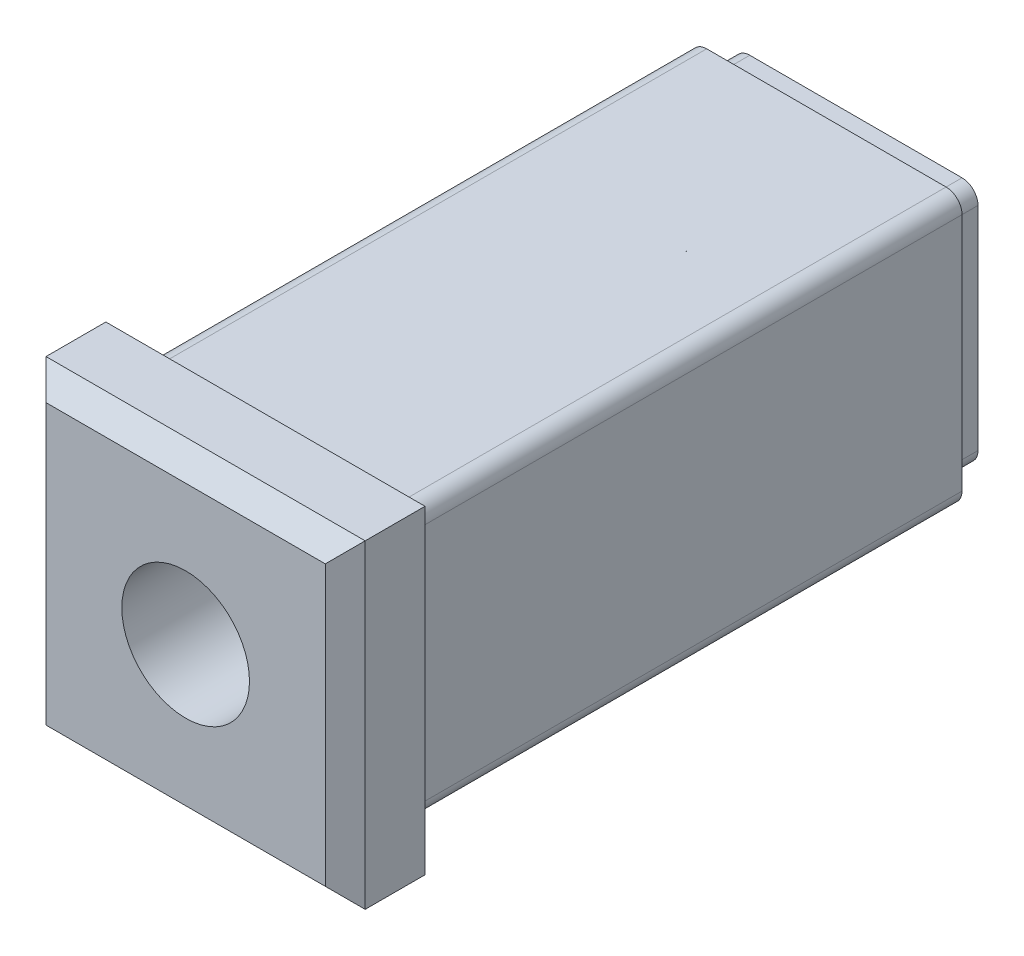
ISO-10303-21;
HEADER;
FILE_DESCRIPTION(('STEP AP214'),'2;1');
FILE_NAME('part.step','',(''),(''),'','','');
FILE_SCHEMA(('AUTOMOTIVE_DESIGN { 1 0 10303 214 1 1 1 1 }'));
ENDSEC;
DATA;
#1=APPLICATION_CONTEXT('core data for automotive mechanical design processes');
#2=APPLICATION_PROTOCOL_DEFINITION('international standard','automotive_design',2000,#1);
#3=PRODUCT_CONTEXT('',#1,'mechanical');
#4=PRODUCT('Part','Part','',(#3));
#5=PRODUCT_RELATED_PRODUCT_CATEGORY('part','',(#4));
#6=PRODUCT_DEFINITION_FORMATION('','',#4);
#7=PRODUCT_DEFINITION_CONTEXT('part definition',#1,'design');
#8=PRODUCT_DEFINITION('design','',#6,#7);
#9=PRODUCT_DEFINITION_SHAPE('','',#8);
#10=(LENGTH_UNIT() NAMED_UNIT(*) SI_UNIT(.MILLI.,.METRE.));
#11=(NAMED_UNIT(*) PLANE_ANGLE_UNIT() SI_UNIT($,.RADIAN.));
#12=(NAMED_UNIT(*) SI_UNIT($,.STERADIAN.) SOLID_ANGLE_UNIT());
#13=UNCERTAINTY_MEASURE_WITH_UNIT(LENGTH_MEASURE(1.E-05),#10,'distance_accuracy_value','');
#14=(GEOMETRIC_REPRESENTATION_CONTEXT(3) GLOBAL_UNCERTAINTY_ASSIGNED_CONTEXT((#13)) GLOBAL_UNIT_ASSIGNED_CONTEXT((#10,
#11,#12)) REPRESENTATION_CONTEXT('',''));
#15=CARTESIAN_POINT('',(0.,0.,0.));
#16=DIRECTION('',(0.,0.,1.));
#17=DIRECTION('',(1.,0.,0.));
#18=AXIS2_PLACEMENT_3D('',#15,#16,#17);
#19=CARTESIAN_POINT('',(0.,8.75,5.));
#20=DIRECTION('',(0.,0.,1.));
#21=DIRECTION('',(-1.,0.,0.));
#22=AXIS2_PLACEMENT_3D('',#19,#20,#21);
#23=PLANE('',#22);
#24=DIRECTION('',(1.,0.,0.));
#25=VECTOR('',#24,1.);
#26=CARTESIAN_POINT('',(0.,-8.75,5.));
#27=LINE('',#26,#25);
#28=CARTESIAN_POINT('',(8.75,-8.75,5.));
#29=VERTEX_POINT('',#28);
#30=CARTESIAN_POINT('',(-8.75,-8.75,5.));
#31=VERTEX_POINT('',#30);
#32=EDGE_CURVE('E237',#29,#31,#27,.F.);
#33=ORIENTED_EDGE('',*,*,#32,.F.);
#34=DIRECTION('',(0.,-1.,0.));
#35=VECTOR('',#34,1.);
#36=CARTESIAN_POINT('',(8.75,37.,5.));
#37=LINE('',#36,#35);
#38=CARTESIAN_POINT('',(8.75,8.75,5.));
#39=VERTEX_POINT('',#38);
#40=EDGE_CURVE('E188',#29,#39,#37,.F.);
#41=ORIENTED_EDGE('',*,*,#40,.T.);
#42=DIRECTION('',(1.,0.,0.));
#43=VECTOR('',#42,1.);
#44=CARTESIAN_POINT('',(0.,8.75,5.));
#45=LINE('',#44,#43);
#46=CARTESIAN_POINT('',(-8.75,8.75,5.));
#47=VERTEX_POINT('',#46);
#48=EDGE_CURVE('E347',#47,#39,#45,.T.);
#49=ORIENTED_EDGE('',*,*,#48,.F.);
#50=DIRECTION('',(0.,-1.,0.));
#51=VECTOR('',#50,1.);
#52=CARTESIAN_POINT('',(-8.75,-20.,5.));
#53=LINE('',#52,#51);
#54=EDGE_CURVE('E360',#47,#31,#53,.T.);
#55=ORIENTED_EDGE('',*,*,#54,.T.);
#56=EDGE_LOOP('',(#33,#41,#49,#55));
#57=FACE_BOUND('',#56,.T.);
#58=CARTESIAN_POINT('',(0.,0.,5.));
#59=DIRECTION('',(0.,0.,1.));
#60=DIRECTION('',(-1.,0.,0.));
#61=AXIS2_PLACEMENT_3D('',#58,#59,#60);
#62=CIRCLE('',#61,4.);
#63=CARTESIAN_POINT('',(-4.,0.,5.));
#64=VERTEX_POINT('',#63);
#65=EDGE_CURVE('E191',#64,#64,#62,.F.);
#66=ORIENTED_EDGE('',*,*,#65,.T.);
#67=EDGE_LOOP('',(#66));
#68=FACE_BOUND('',#67,.T.);
#69=ADVANCED_FACE('F14',(#57,#68),#23,.T.);
#70=CARTESIAN_POINT('',(-10.,-20.,3.75));
#71=DIRECTION('',(0.707106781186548,0.,-0.707106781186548));
#72=DIRECTION('',(0.707106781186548,0.,0.707106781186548));
#73=AXIS2_PLACEMENT_3D('',#70,#71,#72);
#74=PLANE('',#73);
#75=DIRECTION('',(0.,-1.,0.));
#76=VECTOR('',#75,1.);
#77=CARTESIAN_POINT('',(-10.,0.,3.75));
#78=LINE('',#77,#76);
#79=CARTESIAN_POINT('',(-10.,10.,3.75));
#80=VERTEX_POINT('',#79);
#81=CARTESIAN_POINT('',(-10.,-10.,3.75));
#82=VERTEX_POINT('',#81);
#83=EDGE_CURVE('E338',#80,#82,#78,.T.);
#84=ORIENTED_EDGE('',*,*,#83,.T.);
#85=DIRECTION('',(-0.577350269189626,-0.577350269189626,-0.577350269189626));
#86=VECTOR('',#85,1.);
#87=CARTESIAN_POINT('',(-8.75,-8.75,5.));
#88=LINE('',#87,#86);
#89=EDGE_CURVE('E363',#31,#82,#88,.T.);
#90=ORIENTED_EDGE('',*,*,#89,.F.);
#91=ORIENTED_EDGE('',*,*,#54,.F.);
#92=DIRECTION('',(0.577350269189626,-0.577350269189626,0.577350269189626));
#93=VECTOR('',#92,1.);
#94=CARTESIAN_POINT('',(-10.,10.,3.75));
#95=LINE('',#94,#93);
#96=EDGE_CURVE('E349',#80,#47,#95,.T.);
#97=ORIENTED_EDGE('',*,*,#96,.F.);
#98=EDGE_LOOP('',(#84,#90,#91,#97));
#99=FACE_BOUND('',#98,.T.);
#100=ADVANCED_FACE('F441',(#99),#74,.F.);
#101=CARTESIAN_POINT('',(0.,-8.75,5.));
#102=DIRECTION('',(0.,-0.707106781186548,0.707106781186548));
#103=DIRECTION('',(0.,-0.707106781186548,-0.707106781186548));
#104=AXIS2_PLACEMENT_3D('',#101,#102,#103);
#105=PLANE('',#104);
#106=DIRECTION('',(-1.,0.,0.));
#107=VECTOR('',#106,1.);
#108=CARTESIAN_POINT('',(0.,-10.,3.75));
#109=LINE('',#108,#107);
#110=CARTESIAN_POINT('',(10.,-10.,3.75));
#111=VERTEX_POINT('',#110);
#112=EDGE_CURVE('E18',#111,#82,#109,.T.);
#113=ORIENTED_EDGE('',*,*,#112,.F.);
#114=DIRECTION('',(-0.577350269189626,0.577350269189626,0.577350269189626));
#115=VECTOR('',#114,1.);
#116=CARTESIAN_POINT('',(10.,-10.,3.75));
#117=LINE('',#116,#115);
#118=EDGE_CURVE('E164',#111,#29,#117,.T.);
#119=ORIENTED_EDGE('',*,*,#118,.T.);
#120=ORIENTED_EDGE('',*,*,#32,.T.);
#121=ORIENTED_EDGE('',*,*,#89,.T.);
#122=EDGE_LOOP('',(#113,#119,#120,#121));
#123=FACE_BOUND('',#122,.T.);
#124=ADVANCED_FACE('F443',(#123),#105,.T.);
#125=CARTESIAN_POINT('',(0.,10.,3.75));
#126=DIRECTION('',(0.,0.707106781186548,0.707106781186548));
#127=DIRECTION('',(0.,-0.707106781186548,0.707106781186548));
#128=AXIS2_PLACEMENT_3D('',#125,#126,#127);
#129=PLANE('',#128);
#130=ORIENTED_EDGE('',*,*,#48,.T.);
#131=DIRECTION('',(0.577350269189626,0.577350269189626,-0.577350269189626));
#132=VECTOR('',#131,1.);
#133=CARTESIAN_POINT('',(8.75,8.75,5.));
#134=LINE('',#133,#132);
#135=CARTESIAN_POINT('',(10.,10.,3.75));
#136=VERTEX_POINT('',#135);
#137=EDGE_CURVE('E187',#39,#136,#134,.T.);
#138=ORIENTED_EDGE('',*,*,#137,.T.);
#139=DIRECTION('',(1.,0.,0.));
#140=VECTOR('',#139,1.);
#141=CARTESIAN_POINT('',(0.,10.,3.75));
#142=LINE('',#141,#140);
#143=EDGE_CURVE('E333',#80,#136,#142,.T.);
#144=ORIENTED_EDGE('',*,*,#143,.F.);
#145=ORIENTED_EDGE('',*,*,#96,.T.);
#146=EDGE_LOOP('',(#130,#138,#144,#145));
#147=FACE_BOUND('',#146,.T.);
#148=ADVANCED_FACE('F446',(#147),#129,.T.);
#149=CARTESIAN_POINT('',(0.,-10.,-37.));
#150=DIRECTION('',(0.,0.,-1.));
#151=DIRECTION('',(1.,0.,0.));
#152=AXIS2_PLACEMENT_3D('',#149,#150,#151);
#153=PLANE('',#152);
#154=DIRECTION('',(0.,-1.,0.));
#155=VECTOR('',#154,1.);
#156=CARTESIAN_POINT('',(-7.65,-6.65,-37.));
#157=LINE('',#156,#155);
#158=CARTESIAN_POINT('',(-7.65,-6.65,-37.));
#159=VERTEX_POINT('',#158);
#160=CARTESIAN_POINT('',(-7.65,6.65,-37.));
#161=VERTEX_POINT('',#160);
#162=EDGE_CURVE('E322',#159,#161,#157,.F.);
#163=ORIENTED_EDGE('',*,*,#162,.T.);
#164=CARTESIAN_POINT('',(-6.65,6.65,-37.));
#165=DIRECTION('',(0.,0.,1.));
#166=DIRECTION('',(-1.,0.,0.));
#167=AXIS2_PLACEMENT_3D('',#164,#165,#166);
#168=CIRCLE('',#167,1.);
#169=CARTESIAN_POINT('',(-6.65,7.65,-37.));
#170=VERTEX_POINT('',#169);
#171=EDGE_CURVE('E375',#161,#170,#168,.F.);
#172=ORIENTED_EDGE('',*,*,#171,.T.);
#173=DIRECTION('',(-1.,0.,0.));
#174=VECTOR('',#173,1.);
#175=CARTESIAN_POINT('',(-6.65,7.65,-37.));
#176=LINE('',#175,#174);
#177=CARTESIAN_POINT('',(6.65,7.65,-37.));
#178=VERTEX_POINT('',#177);
#179=EDGE_CURVE('E327',#170,#178,#176,.F.);
#180=ORIENTED_EDGE('',*,*,#179,.T.);
#181=CARTESIAN_POINT('',(6.65,6.65,-37.));
#182=DIRECTION('',(0.,0.,1.));
#183=DIRECTION('',(-1.,0.,0.));
#184=AXIS2_PLACEMENT_3D('',#181,#182,#183);
#185=CIRCLE('',#184,1.);
#186=CARTESIAN_POINT('',(7.65,6.65,-37.));
#187=VERTEX_POINT('',#186);
#188=EDGE_CURVE('E211',#178,#187,#185,.F.);
#189=ORIENTED_EDGE('',*,*,#188,.T.);
#190=DIRECTION('',(0.,1.,0.));
#191=VECTOR('',#190,1.);
#192=CARTESIAN_POINT('',(7.65,6.65,-37.));
#193=LINE('',#192,#191);
#194=CARTESIAN_POINT('',(7.65,-6.65,-37.));
#195=VERTEX_POINT('',#194);
#196=EDGE_CURVE('E181',#187,#195,#193,.F.);
#197=ORIENTED_EDGE('',*,*,#196,.T.);
#198=CARTESIAN_POINT('',(6.65,-6.65,-37.));
#199=DIRECTION('',(0.,0.,1.));
#200=DIRECTION('',(-1.,0.,0.));
#201=AXIS2_PLACEMENT_3D('',#198,#199,#200);
#202=CIRCLE('',#201,1.);
#203=CARTESIAN_POINT('',(6.65,-7.65,-37.));
#204=VERTEX_POINT('',#203);
#205=EDGE_CURVE('E193',#195,#204,#202,.F.);
#206=ORIENTED_EDGE('',*,*,#205,.T.);
#207=DIRECTION('',(1.,0.,0.));
#208=VECTOR('',#207,1.);
#209=CARTESIAN_POINT('',(6.65,-7.65,-37.));
#210=LINE('',#209,#208);
#211=CARTESIAN_POINT('',(-6.65,-7.65,-37.));
#212=VERTEX_POINT('',#211);
#213=EDGE_CURVE('E167',#204,#212,#210,.F.);
#214=ORIENTED_EDGE('',*,*,#213,.T.);
#215=CARTESIAN_POINT('',(-6.65,-6.65,-37.));
#216=DIRECTION('',(0.,0.,1.));
#217=DIRECTION('',(-1.,0.,0.));
#218=AXIS2_PLACEMENT_3D('',#215,#216,#217);
#219=CIRCLE('',#218,1.);
#220=EDGE_CURVE('E377',#212,#159,#219,.F.);
#221=ORIENTED_EDGE('',*,*,#220,.T.);
#222=EDGE_LOOP('',(#163,#172,#180,#189,#197,#206,#214,#221));
#223=FACE_BOUND('',#222,.T.);
#224=CARTESIAN_POINT('',(0.,0.,-37.));
#225=DIRECTION('',(0.,0.,-1.));
#226=DIRECTION('',(1.,0.,0.));
#227=AXIS2_PLACEMENT_3D('',#224,#225,#226);
#228=CIRCLE('',#227,4.);
#229=CARTESIAN_POINT('',(4.,0.,-37.));
#230=VERTEX_POINT('',#229);
#231=EDGE_CURVE('E651',#230,#230,#228,.T.);
#232=ORIENTED_EDGE('',*,*,#231,.F.);
#233=EDGE_LOOP('',(#232));
#234=FACE_BOUND('',#233,.T.);
#235=ADVANCED_FACE('F389',(#223,#234),#153,.T.);
#236=CARTESIAN_POINT('',(0.,10.,-37.));
#237=DIRECTION('',(0.,1.,0.));
#238=DIRECTION('',(1.,0.,0.));
#239=AXIS2_PLACEMENT_3D('',#236,#237,#238);
#240=PLANE('',#239);
#241=ORIENTED_EDGE('',*,*,#143,.T.);
#242=DIRECTION('',(0.,0.,-1.));
#243=VECTOR('',#242,1.);
#244=CARTESIAN_POINT('',(10.,10.,5.));
#245=LINE('',#244,#243);
#246=CARTESIAN_POINT('',(10.,10.,0.));
#247=VERTEX_POINT('',#246);
#248=EDGE_CURVE('E174',#136,#247,#245,.T.);
#249=ORIENTED_EDGE('',*,*,#248,.T.);
#250=DIRECTION('',(1.,0.,0.));
#251=VECTOR('',#250,1.);
#252=CARTESIAN_POINT('',(0.,10.,0.));
#253=LINE('',#252,#251);
#254=CARTESIAN_POINT('',(-10.,10.,0.));
#255=VERTEX_POINT('',#254);
#256=EDGE_CURVE('E309',#255,#247,#253,.T.);
#257=ORIENTED_EDGE('',*,*,#256,.F.);
#258=DIRECTION('',(0.,0.,-1.));
#259=VECTOR('',#258,1.);
#260=CARTESIAN_POINT('',(-10.,10.,-37.));
#261=LINE('',#260,#259);
#262=EDGE_CURVE('E337',#255,#80,#261,.F.);
#263=ORIENTED_EDGE('',*,*,#262,.T.);
#264=EDGE_LOOP('',(#241,#249,#257,#263));
#265=FACE_BOUND('',#264,.T.);
#266=ADVANCED_FACE('F467',(#265),#240,.T.);
#267=CARTESIAN_POINT('',(-10.,0.,5.));
#268=DIRECTION('',(1.,0.,0.));
#269=DIRECTION('',(0.,-1.,0.));
#270=AXIS2_PLACEMENT_3D('',#267,#268,#269);
#271=PLANE('',#270);
#272=DIRECTION('',(0.,0.,-1.));
#273=VECTOR('',#272,1.);
#274=CARTESIAN_POINT('',(-10.,-10.,5.));
#275=LINE('',#274,#273);
#276=CARTESIAN_POINT('',(-10.,-10.,0.));
#277=VERTEX_POINT('',#276);
#278=EDGE_CURVE('E334',#82,#277,#275,.T.);
#279=ORIENTED_EDGE('',*,*,#278,.F.);
#280=ORIENTED_EDGE('',*,*,#83,.F.);
#281=ORIENTED_EDGE('',*,*,#262,.F.);
#282=DIRECTION('',(0.,-1.,0.));
#283=VECTOR('',#282,1.);
#284=CARTESIAN_POINT('',(-10.,0.,0.));
#285=LINE('',#284,#283);
#286=EDGE_CURVE('E312',#277,#255,#285,.F.);
#287=ORIENTED_EDGE('',*,*,#286,.F.);
#288=EDGE_LOOP('',(#279,#280,#281,#287));
#289=FACE_BOUND('',#288,.T.);
#290=ADVANCED_FACE('F470',(#289),#271,.F.);
#291=CARTESIAN_POINT('',(0.,-10.,3.75));
#292=DIRECTION('',(0.,-1.,0.));
#293=DIRECTION('',(-1.,0.,0.));
#294=AXIS2_PLACEMENT_3D('',#291,#292,#293);
#295=PLANE('',#294);
#296=ORIENTED_EDGE('',*,*,#112,.T.);
#297=ORIENTED_EDGE('',*,*,#278,.T.);
#298=DIRECTION('',(1.,0.,0.));
#299=VECTOR('',#298,1.);
#300=CARTESIAN_POINT('',(0.,-10.,0.));
#301=LINE('',#300,#299);
#302=CARTESIAN_POINT('',(10.,-10.,0.));
#303=VERTEX_POINT('',#302);
#304=EDGE_CURVE('E315',#303,#277,#301,.F.);
#305=ORIENTED_EDGE('',*,*,#304,.F.);
#306=DIRECTION('',(0.,0.,-1.));
#307=VECTOR('',#306,1.);
#308=CARTESIAN_POINT('',(10.,-10.,-37.));
#309=LINE('',#308,#307);
#310=EDGE_CURVE('E169',#303,#111,#309,.F.);
#311=ORIENTED_EDGE('',*,*,#310,.T.);
#312=EDGE_LOOP('',(#296,#297,#305,#311));
#313=FACE_BOUND('',#312,.T.);
#314=ADVANCED_FACE('F474',(#313),#295,.T.);
#315=CARTESIAN_POINT('',(-8.5,-7.5,0.));
#316=DIRECTION('',(1.,0.,0.));
#317=DIRECTION('',(0.,-1.,0.));
#318=AXIS2_PLACEMENT_3D('',#315,#316,#317);
#319=PLANE('',#318);
#320=DIRECTION('',(0.,0.,-1.));
#321=VECTOR('',#320,1.);
#322=CARTESIAN_POINT('',(-8.5,-7.5,0.));
#323=LINE('',#322,#321);
#324=CARTESIAN_POINT('',(-8.5,-7.5,0.));
#325=VERTEX_POINT('',#324);
#326=CARTESIAN_POINT('',(-8.5,-7.5,-35.15));
#327=VERTEX_POINT('',#326);
#328=EDGE_CURVE('E24',#325,#327,#323,.T.);
#329=ORIENTED_EDGE('',*,*,#328,.F.);
#330=DIRECTION('',(0.,-1.,0.));
#331=VECTOR('',#330,1.);
#332=CARTESIAN_POINT('',(-8.5,-7.5,0.));
#333=LINE('',#332,#331);
#334=CARTESIAN_POINT('',(-8.5,7.5,0.));
#335=VERTEX_POINT('',#334);
#336=EDGE_CURVE('E279',#335,#325,#333,.T.);
#337=ORIENTED_EDGE('',*,*,#336,.F.);
#338=DIRECTION('',(0.,0.,-1.));
#339=VECTOR('',#338,1.);
#340=CARTESIAN_POINT('',(-8.5,7.5,0.));
#341=LINE('',#340,#339);
#342=CARTESIAN_POINT('',(-8.5,7.5,-35.15));
#343=VERTEX_POINT('',#342);
#344=EDGE_CURVE('E276',#343,#335,#341,.F.);
#345=ORIENTED_EDGE('',*,*,#344,.F.);
#346=DIRECTION('',(0.,-1.,0.));
#347=VECTOR('',#346,1.);
#348=CARTESIAN_POINT('',(-8.5,-7.5,-35.15));
#349=LINE('',#348,#347);
#350=EDGE_CURVE('E9',#327,#343,#349,.F.);
#351=ORIENTED_EDGE('',*,*,#350,.F.);
#352=EDGE_LOOP('',(#329,#337,#345,#351));
#353=FACE_BOUND('',#352,.T.);
#354=ADVANCED_FACE('F477',(#353),#319,.F.);
#355=CARTESIAN_POINT('',(-7.5,-7.5,0.));
#356=DIRECTION('',(0.,0.,1.));
#357=DIRECTION('',(-1.,0.,0.));
#358=AXIS2_PLACEMENT_3D('',#355,#356,#357);
#359=CYLINDRICAL_SURFACE('',#358,1.);
#360=CARTESIAN_POINT('',(-7.5,-7.5,0.));
#361=DIRECTION('',(0.,0.,1.));
#362=DIRECTION('',(-1.,0.,0.));
#363=AXIS2_PLACEMENT_3D('',#360,#361,#362);
#364=CIRCLE('',#363,1.);
#365=CARTESIAN_POINT('',(-7.5,-8.5,0.));
#366=VERTEX_POINT('',#365);
#367=EDGE_CURVE('E295',#366,#325,#364,.F.);
#368=ORIENTED_EDGE('',*,*,#367,.T.);
#369=ORIENTED_EDGE('',*,*,#328,.T.);
#370=CARTESIAN_POINT('',(-7.5,-7.5,-35.15));
#371=DIRECTION('',(0.,0.,1.));
#372=DIRECTION('',(-1.,0.,0.));
#373=AXIS2_PLACEMENT_3D('',#370,#371,#372);
#374=CIRCLE('',#373,1.);
#375=CARTESIAN_POINT('',(-7.5,-8.5,-35.15));
#376=VERTEX_POINT('',#375);
#377=EDGE_CURVE('E32',#376,#327,#374,.F.);
#378=ORIENTED_EDGE('',*,*,#377,.F.);
#379=DIRECTION('',(0.,0.,1.));
#380=VECTOR('',#379,1.);
#381=CARTESIAN_POINT('',(-7.5,-8.5,0.));
#382=LINE('',#381,#380);
#383=EDGE_CURVE('E304',#376,#366,#382,.T.);
#384=ORIENTED_EDGE('',*,*,#383,.T.);
#385=EDGE_LOOP('',(#368,#369,#378,#384));
#386=FACE_BOUND('',#385,.T.);
#387=ADVANCED_FACE('F512',(#386),#359,.T.);
#388=CARTESIAN_POINT('',(7.5,-8.5,0.));
#389=DIRECTION('',(0.,1.,0.));
#390=DIRECTION('',(1.,0.,0.));
#391=AXIS2_PLACEMENT_3D('',#388,#389,#390);
#392=PLANE('',#391);
#393=DIRECTION('',(1.,0.,0.));
#394=VECTOR('',#393,1.);
#395=CARTESIAN_POINT('',(0.,-8.5,-35.15));
#396=LINE('',#395,#394);
#397=CARTESIAN_POINT('',(7.5,-8.5,-35.15));
#398=VERTEX_POINT('',#397);
#399=EDGE_CURVE('E153',#398,#376,#396,.F.);
#400=ORIENTED_EDGE('',*,*,#399,.F.);
#401=DIRECTION('',(0.,0.,1.));
#402=VECTOR('',#401,1.);
#403=CARTESIAN_POINT('',(7.5,-8.5,0.));
#404=LINE('',#403,#402);
#405=CARTESIAN_POINT('',(7.5,-8.5,0.));
#406=VERTEX_POINT('',#405);
#407=EDGE_CURVE('E244',#406,#398,#404,.F.);
#408=ORIENTED_EDGE('',*,*,#407,.F.);
#409=DIRECTION('',(1.,0.,0.));
#410=VECTOR('',#409,1.);
#411=CARTESIAN_POINT('',(0.,-8.5,0.));
#412=LINE('',#411,#410);
#413=EDGE_CURVE('E302',#366,#406,#412,.T.);
#414=ORIENTED_EDGE('',*,*,#413,.F.);
#415=ORIENTED_EDGE('',*,*,#383,.F.);
#416=EDGE_LOOP('',(#400,#408,#414,#415));
#417=FACE_BOUND('',#416,.T.);
#418=ADVANCED_FACE('F405',(#417),#392,.F.);
#419=CARTESIAN_POINT('',(6.65,-7.65,-35.15));
#420=DIRECTION('',(0.,1.,0.));
#421=DIRECTION('',(1.,0.,0.));
#422=AXIS2_PLACEMENT_3D('',#419,#420,#421);
#423=PLANE('',#422);
#424=ORIENTED_EDGE('',*,*,#213,.F.);
#425=DIRECTION('',(0.,0.,-1.));
#426=VECTOR('',#425,1.);
#427=CARTESIAN_POINT('',(6.65,-7.65,-35.15));
#428=LINE('',#427,#426);
#429=CARTESIAN_POINT('',(6.65,-7.65,-35.15));
#430=VERTEX_POINT('',#429);
#431=EDGE_CURVE('E160',#430,#204,#428,.T.);
#432=ORIENTED_EDGE('',*,*,#431,.F.);
#433=DIRECTION('',(1.,0.,0.));
#434=VECTOR('',#433,1.);
#435=CARTESIAN_POINT('',(0.,-7.65,-35.15));
#436=LINE('',#435,#434);
#437=CARTESIAN_POINT('',(-6.65,-7.65,-35.15));
#438=VERTEX_POINT('',#437);
#439=EDGE_CURVE('E146',#438,#430,#436,.T.);
#440=ORIENTED_EDGE('',*,*,#439,.F.);
#441=DIRECTION('',(0.,0.,-1.));
#442=VECTOR('',#441,1.);
#443=CARTESIAN_POINT('',(-6.65,-7.65,-35.15));
#444=LINE('',#443,#442);
#445=EDGE_CURVE('E320',#212,#438,#444,.F.);
#446=ORIENTED_EDGE('',*,*,#445,.F.);
#447=EDGE_LOOP('',(#424,#432,#440,#446));
#448=FACE_BOUND('',#447,.T.);
#449=ADVANCED_FACE('F165',(#448),#423,.F.);
#450=CARTESIAN_POINT('',(-6.65,-6.65,-35.15));
#451=DIRECTION('',(0.,0.,1.));
#452=DIRECTION('',(-1.,0.,0.));
#453=AXIS2_PLACEMENT_3D('',#450,#451,#452);
#454=CYLINDRICAL_SURFACE('',#453,1.);
#455=CARTESIAN_POINT('',(-6.65,-6.65,-35.15));
#456=DIRECTION('',(0.,0.,1.));
#457=DIRECTION('',(-1.,0.,0.));
#458=AXIS2_PLACEMENT_3D('',#455,#456,#457);
#459=CIRCLE('',#458,1.);
#460=CARTESIAN_POINT('',(-7.65,-6.65,-35.15));
#461=VERTEX_POINT('',#460);
#462=EDGE_CURVE('E149',#438,#461,#459,.F.);
#463=ORIENTED_EDGE('',*,*,#462,.T.);
#464=DIRECTION('',(0.,0.,-1.));
#465=VECTOR('',#464,1.);
#466=CARTESIAN_POINT('',(-7.65,-6.65,-35.15));
#467=LINE('',#466,#465);
#468=EDGE_CURVE('E326',#461,#159,#467,.T.);
#469=ORIENTED_EDGE('',*,*,#468,.T.);
#470=ORIENTED_EDGE('',*,*,#220,.F.);
#471=ORIENTED_EDGE('',*,*,#445,.T.);
#472=EDGE_LOOP('',(#463,#469,#470,#471));
#473=FACE_BOUND('',#472,.T.);
#474=ADVANCED_FACE('F395',(#473),#454,.T.);
#475=CARTESIAN_POINT('',(-7.65,-6.65,-35.15));
#476=DIRECTION('',(1.,0.,0.));
#477=DIRECTION('',(0.,-1.,0.));
#478=AXIS2_PLACEMENT_3D('',#475,#476,#477);
#479=PLANE('',#478);
#480=ORIENTED_EDGE('',*,*,#468,.F.);
#481=DIRECTION('',(0.,-1.,0.));
#482=VECTOR('',#481,1.);
#483=CARTESIAN_POINT('',(-7.65,0.,-35.15));
#484=LINE('',#483,#482);
#485=CARTESIAN_POINT('',(-7.65,6.65,-35.15));
#486=VERTEX_POINT('',#485);
#487=EDGE_CURVE('E154',#486,#461,#484,.T.);
#488=ORIENTED_EDGE('',*,*,#487,.F.);
#489=DIRECTION('',(0.,0.,-1.));
#490=VECTOR('',#489,1.);
#491=CARTESIAN_POINT('',(-7.65,6.65,-35.15));
#492=LINE('',#491,#490);
#493=EDGE_CURVE('E323',#161,#486,#492,.F.);
#494=ORIENTED_EDGE('',*,*,#493,.F.);
#495=ORIENTED_EDGE('',*,*,#162,.F.);
#496=EDGE_LOOP('',(#480,#488,#494,#495));
#497=FACE_BOUND('',#496,.T.);
#498=ADVANCED_FACE('F394',(#497),#479,.F.);
#499=CARTESIAN_POINT('',(-6.65,6.65,-35.15));
#500=DIRECTION('',(0.,0.,1.));
#501=DIRECTION('',(-1.,0.,0.));
#502=AXIS2_PLACEMENT_3D('',#499,#500,#501);
#503=CYLINDRICAL_SURFACE('',#502,1.);
#504=CARTESIAN_POINT('',(-6.65,6.65,-35.15));
#505=DIRECTION('',(0.,0.,1.));
#506=DIRECTION('',(-1.,0.,0.));
#507=AXIS2_PLACEMENT_3D('',#504,#505,#506);
#508=CIRCLE('',#507,1.);
#509=CARTESIAN_POINT('',(-6.65,7.65,-35.15));
#510=VERTEX_POINT('',#509);
#511=EDGE_CURVE('E228',#486,#510,#508,.F.);
#512=ORIENTED_EDGE('',*,*,#511,.T.);
#513=DIRECTION('',(0.,0.,-1.));
#514=VECTOR('',#513,1.);
#515=CARTESIAN_POINT('',(-6.65,7.65,-35.15));
#516=LINE('',#515,#514);
#517=EDGE_CURVE('E330',#510,#170,#516,.T.);
#518=ORIENTED_EDGE('',*,*,#517,.T.);
#519=ORIENTED_EDGE('',*,*,#171,.F.);
#520=ORIENTED_EDGE('',*,*,#493,.T.);
#521=EDGE_LOOP('',(#512,#518,#519,#520));
#522=FACE_BOUND('',#521,.T.);
#523=ADVANCED_FACE('F382',(#522),#503,.T.);
#524=CARTESIAN_POINT('',(-6.65,7.65,-35.15));
#525=DIRECTION('',(0.,-1.,0.));
#526=DIRECTION('',(-1.,0.,0.));
#527=AXIS2_PLACEMENT_3D('',#524,#525,#526);
#528=PLANE('',#527);
#529=ORIENTED_EDGE('',*,*,#517,.F.);
#530=DIRECTION('',(1.,0.,0.));
#531=VECTOR('',#530,1.);
#532=CARTESIAN_POINT('',(0.,7.65,-35.15));
#533=LINE('',#532,#531);
#534=CARTESIAN_POINT('',(6.65,7.65,-35.15));
#535=VERTEX_POINT('',#534);
#536=EDGE_CURVE('E293',#535,#510,#533,.F.);
#537=ORIENTED_EDGE('',*,*,#536,.F.);
#538=DIRECTION('',(0.,0.,-1.));
#539=VECTOR('',#538,1.);
#540=CARTESIAN_POINT('',(6.65,7.65,-35.15));
#541=LINE('',#540,#539);
#542=EDGE_CURVE('E184',#178,#535,#541,.F.);
#543=ORIENTED_EDGE('',*,*,#542,.F.);
#544=ORIENTED_EDGE('',*,*,#179,.F.);
#545=EDGE_LOOP('',(#529,#537,#543,#544));
#546=FACE_BOUND('',#545,.T.);
#547=ADVANCED_FACE('F387',(#546),#528,.F.);
#548=CARTESIAN_POINT('',(-7.5,8.5,0.));
#549=DIRECTION('',(0.,-1.,0.));
#550=DIRECTION('',(-1.,0.,0.));
#551=AXIS2_PLACEMENT_3D('',#548,#549,#550);
#552=PLANE('',#551);
#553=DIRECTION('',(0.,0.,1.));
#554=VECTOR('',#553,1.);
#555=CARTESIAN_POINT('',(-7.5,8.5,0.));
#556=LINE('',#555,#554);
#557=CARTESIAN_POINT('',(-7.5,8.5,0.));
#558=VERTEX_POINT('',#557);
#559=CARTESIAN_POINT('',(-7.5,8.5,-35.15));
#560=VERTEX_POINT('',#559);
#561=EDGE_CURVE('E316',#558,#560,#556,.F.);
#562=ORIENTED_EDGE('',*,*,#561,.F.);
#563=DIRECTION('',(1.,0.,0.));
#564=VECTOR('',#563,1.);
#565=CARTESIAN_POINT('',(0.,8.5,0.));
#566=LINE('',#565,#564);
#567=CARTESIAN_POINT('',(7.5,8.5,0.));
#568=VERTEX_POINT('',#567);
#569=EDGE_CURVE('E260',#568,#558,#566,.F.);
#570=ORIENTED_EDGE('',*,*,#569,.F.);
#571=DIRECTION('',(0.,0.,1.));
#572=VECTOR('',#571,1.);
#573=CARTESIAN_POINT('',(7.5,8.5,0.));
#574=LINE('',#573,#572);
#575=CARTESIAN_POINT('',(7.5,8.5,-35.15));
#576=VERTEX_POINT('',#575);
#577=EDGE_CURVE('E206',#576,#568,#574,.T.);
#578=ORIENTED_EDGE('',*,*,#577,.F.);
#579=DIRECTION('',(1.,0.,0.));
#580=VECTOR('',#579,1.);
#581=CARTESIAN_POINT('',(0.,8.5,-35.15));
#582=LINE('',#581,#580);
#583=EDGE_CURVE('E272',#560,#576,#582,.T.);
#584=ORIENTED_EDGE('',*,*,#583,.F.);
#585=EDGE_LOOP('',(#562,#570,#578,#584));
#586=FACE_BOUND('',#585,.T.);
#587=ADVANCED_FACE('F458',(#586),#552,.F.);
#588=CARTESIAN_POINT('',(-7.5,7.5,0.));
#589=DIRECTION('',(0.,0.,1.));
#590=DIRECTION('',(-1.,0.,0.));
#591=AXIS2_PLACEMENT_3D('',#588,#589,#590);
#592=CYLINDRICAL_SURFACE('',#591,1.);
#593=CARTESIAN_POINT('',(-7.5,7.5,0.));
#594=DIRECTION('',(0.,0.,1.));
#595=DIRECTION('',(-1.,0.,0.));
#596=AXIS2_PLACEMENT_3D('',#593,#594,#595);
#597=CIRCLE('',#596,1.);
#598=EDGE_CURVE('E305',#558,#335,#597,.T.);
#599=ORIENTED_EDGE('',*,*,#598,.F.);
#600=ORIENTED_EDGE('',*,*,#561,.T.);
#601=CARTESIAN_POINT('',(-7.5,7.5,-35.15));
#602=DIRECTION('',(0.,0.,1.));
#603=DIRECTION('',(-1.,0.,0.));
#604=AXIS2_PLACEMENT_3D('',#601,#602,#603);
#605=CIRCLE('',#604,1.);
#606=EDGE_CURVE('E275',#343,#560,#605,.F.);
#607=ORIENTED_EDGE('',*,*,#606,.F.);
#608=ORIENTED_EDGE('',*,*,#344,.T.);
#609=EDGE_LOOP('',(#599,#600,#607,#608));
#610=FACE_BOUND('',#609,.T.);
#611=ADVANCED_FACE('F464',(#610),#592,.T.);
#612=CARTESIAN_POINT('',(0.,0.,-35.15));
#613=DIRECTION('',(0.,0.,-1.));
#614=DIRECTION('',(1.,0.,0.));
#615=AXIS2_PLACEMENT_3D('',#612,#613,#614);
#616=PLANE('',#615);
#617=ORIENTED_EDGE('',*,*,#439,.T.);
#618=CARTESIAN_POINT('',(6.65,-6.65,-35.15));
#619=DIRECTION('',(0.,0.,1.));
#620=DIRECTION('',(-1.,0.,0.));
#621=AXIS2_PLACEMENT_3D('',#618,#619,#620);
#622=CIRCLE('',#621,1.);
#623=CARTESIAN_POINT('',(7.65,-6.65,-35.15));
#624=VERTEX_POINT('',#623);
#625=EDGE_CURVE('E143',#624,#430,#622,.F.);
#626=ORIENTED_EDGE('',*,*,#625,.F.);
#627=DIRECTION('',(0.,-1.,0.));
#628=VECTOR('',#627,1.);
#629=CARTESIAN_POINT('',(7.65,0.,-35.15));
#630=LINE('',#629,#628);
#631=CARTESIAN_POINT('',(7.65,6.65,-35.15));
#632=VERTEX_POINT('',#631);
#633=EDGE_CURVE('E203',#624,#632,#630,.F.);
#634=ORIENTED_EDGE('',*,*,#633,.T.);
#635=CARTESIAN_POINT('',(6.65,6.65,-35.15));
#636=DIRECTION('',(0.,0.,1.));
#637=DIRECTION('',(-1.,0.,0.));
#638=AXIS2_PLACEMENT_3D('',#635,#636,#637);
#639=CIRCLE('',#638,1.);
#640=EDGE_CURVE('E163',#535,#632,#639,.F.);
#641=ORIENTED_EDGE('',*,*,#640,.F.);
#642=ORIENTED_EDGE('',*,*,#536,.T.);
#643=ORIENTED_EDGE('',*,*,#511,.F.);
#644=ORIENTED_EDGE('',*,*,#487,.T.);
#645=ORIENTED_EDGE('',*,*,#462,.F.);
#646=EDGE_LOOP('',(#617,#626,#634,#641,#642,#643,#644,#645));
#647=FACE_BOUND('',#646,.T.);
#648=ORIENTED_EDGE('',*,*,#606,.T.);
#649=ORIENTED_EDGE('',*,*,#583,.T.);
#650=CARTESIAN_POINT('',(7.5,7.5,-35.15));
#651=DIRECTION('',(0.,0.,1.));
#652=DIRECTION('',(-1.,0.,0.));
#653=AXIS2_PLACEMENT_3D('',#650,#651,#652);
#654=CIRCLE('',#653,1.);
#655=CARTESIAN_POINT('',(8.5,7.5,-35.15));
#656=VERTEX_POINT('',#655);
#657=EDGE_CURVE('E201',#576,#656,#654,.F.);
#658=ORIENTED_EDGE('',*,*,#657,.T.);
#659=DIRECTION('',(0.,1.,0.));
#660=VECTOR('',#659,1.);
#661=CARTESIAN_POINT('',(8.5,7.5,-35.15));
#662=LINE('',#661,#660);
#663=CARTESIAN_POINT('',(8.5,-7.5,-35.15));
#664=VERTEX_POINT('',#663);
#665=EDGE_CURVE('E233',#656,#664,#662,.F.);
#666=ORIENTED_EDGE('',*,*,#665,.T.);
#667=CARTESIAN_POINT('',(7.5,-7.5,-35.15));
#668=DIRECTION('',(0.,0.,1.));
#669=DIRECTION('',(-1.,0.,0.));
#670=AXIS2_PLACEMENT_3D('',#667,#668,#669);
#671=CIRCLE('',#670,1.);
#672=EDGE_CURVE('E197',#664,#398,#671,.F.);
#673=ORIENTED_EDGE('',*,*,#672,.T.);
#674=ORIENTED_EDGE('',*,*,#399,.T.);
#675=ORIENTED_EDGE('',*,*,#377,.T.);
#676=ORIENTED_EDGE('',*,*,#350,.T.);
#677=EDGE_LOOP('',(#648,#649,#658,#666,#673,#674,#675,#676));
#678=FACE_BOUND('',#677,.T.);
#679=ADVANCED_FACE('F147',(#647,#678),#616,.T.);
#680=CARTESIAN_POINT('',(0.,0.,0.));
#681=DIRECTION('',(0.,0.,-1.));
#682=DIRECTION('',(1.,0.,0.));
#683=AXIS2_PLACEMENT_3D('',#680,#681,#682);
#684=PLANE('',#683);
#685=ORIENTED_EDGE('',*,*,#413,.T.);
#686=CARTESIAN_POINT('',(7.5,-7.5,0.));
#687=DIRECTION('',(0.,0.,1.));
#688=DIRECTION('',(-1.,0.,0.));
#689=AXIS2_PLACEMENT_3D('',#686,#687,#688);
#690=CIRCLE('',#689,1.);
#691=CARTESIAN_POINT('',(8.5,-7.5,0.));
#692=VERTEX_POINT('',#691);
#693=EDGE_CURVE('E207',#406,#692,#690,.T.);
#694=ORIENTED_EDGE('',*,*,#693,.T.);
#695=DIRECTION('',(0.,1.,0.));
#696=VECTOR('',#695,1.);
#697=CARTESIAN_POINT('',(8.5,7.5,0.));
#698=LINE('',#697,#696);
#699=CARTESIAN_POINT('',(8.5,7.5,0.));
#700=VERTEX_POINT('',#699);
#701=EDGE_CURVE('E234',#692,#700,#698,.T.);
#702=ORIENTED_EDGE('',*,*,#701,.T.);
#703=CARTESIAN_POINT('',(7.5,7.5,0.));
#704=DIRECTION('',(0.,0.,1.));
#705=DIRECTION('',(-1.,0.,0.));
#706=AXIS2_PLACEMENT_3D('',#703,#704,#705);
#707=CIRCLE('',#706,1.);
#708=EDGE_CURVE('E204',#568,#700,#707,.F.);
#709=ORIENTED_EDGE('',*,*,#708,.F.);
#710=ORIENTED_EDGE('',*,*,#569,.T.);
#711=ORIENTED_EDGE('',*,*,#598,.T.);
#712=ORIENTED_EDGE('',*,*,#336,.T.);
#713=ORIENTED_EDGE('',*,*,#367,.F.);
#714=EDGE_LOOP('',(#685,#694,#702,#709,#710,#711,#712,#713));
#715=FACE_BOUND('',#714,.T.);
#716=DIRECTION('',(0.,-1.,0.));
#717=VECTOR('',#716,1.);
#718=CARTESIAN_POINT('',(10.,0.,0.));
#719=LINE('',#718,#717);
#720=EDGE_CURVE('E209',#247,#303,#719,.T.);
#721=ORIENTED_EDGE('',*,*,#720,.T.);
#722=ORIENTED_EDGE('',*,*,#304,.T.);
#723=ORIENTED_EDGE('',*,*,#286,.T.);
#724=ORIENTED_EDGE('',*,*,#256,.T.);
#725=EDGE_LOOP('',(#721,#722,#723,#724));
#726=FACE_BOUND('',#725,.T.);
#727=ADVANCED_FACE('F258',(#715,#726),#684,.T.);
#728=CARTESIAN_POINT('',(10.,37.,3.75));
#729=DIRECTION('',(-0.707106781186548,0.,-0.707106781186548));
#730=DIRECTION('',(0.707106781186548,0.,-0.707106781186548));
#731=AXIS2_PLACEMENT_3D('',#728,#729,#730);
#732=PLANE('',#731);
#733=DIRECTION('',(0.,1.,0.));
#734=VECTOR('',#733,1.);
#735=CARTESIAN_POINT('',(10.,0.,3.75));
#736=LINE('',#735,#734);
#737=EDGE_CURVE('E180',#111,#136,#736,.T.);
#738=ORIENTED_EDGE('',*,*,#737,.T.);
#739=ORIENTED_EDGE('',*,*,#137,.F.);
#740=ORIENTED_EDGE('',*,*,#40,.F.);
#741=ORIENTED_EDGE('',*,*,#118,.F.);
#742=EDGE_LOOP('',(#738,#739,#740,#741));
#743=FACE_BOUND('',#742,.T.);
#744=ADVANCED_FACE('F16',(#743),#732,.F.);
#745=CARTESIAN_POINT('',(10.,0.,5.));
#746=DIRECTION('',(-1.,0.,0.));
#747=DIRECTION('',(0.,1.,0.));
#748=AXIS2_PLACEMENT_3D('',#745,#746,#747);
#749=PLANE('',#748);
#750=ORIENTED_EDGE('',*,*,#248,.F.);
#751=ORIENTED_EDGE('',*,*,#737,.F.);
#752=ORIENTED_EDGE('',*,*,#310,.F.);
#753=ORIENTED_EDGE('',*,*,#720,.F.);
#754=EDGE_LOOP('',(#750,#751,#752,#753));
#755=FACE_BOUND('',#754,.T.);
#756=ADVANCED_FACE('F410',(#755),#749,.F.);
#757=CARTESIAN_POINT('',(8.5,7.5,0.));
#758=DIRECTION('',(-1.,0.,0.));
#759=DIRECTION('',(0.,1.,0.));
#760=AXIS2_PLACEMENT_3D('',#757,#758,#759);
#761=PLANE('',#760);
#762=DIRECTION('',(0.,0.,-1.));
#763=VECTOR('',#762,1.);
#764=CARTESIAN_POINT('',(8.5,7.5,0.));
#765=LINE('',#764,#763);
#766=EDGE_CURVE('E230',#700,#656,#765,.T.);
#767=ORIENTED_EDGE('',*,*,#766,.F.);
#768=ORIENTED_EDGE('',*,*,#701,.F.);
#769=DIRECTION('',(0.,0.,-1.));
#770=VECTOR('',#769,1.);
#771=CARTESIAN_POINT('',(8.5,-7.5,0.));
#772=LINE('',#771,#770);
#773=EDGE_CURVE('E200',#664,#692,#772,.F.);
#774=ORIENTED_EDGE('',*,*,#773,.F.);
#775=ORIENTED_EDGE('',*,*,#665,.F.);
#776=EDGE_LOOP('',(#767,#768,#774,#775));
#777=FACE_BOUND('',#776,.T.);
#778=ADVANCED_FACE('F265',(#777),#761,.F.);
#779=CARTESIAN_POINT('',(7.5,7.5,0.));
#780=DIRECTION('',(0.,0.,1.));
#781=DIRECTION('',(-1.,0.,0.));
#782=AXIS2_PLACEMENT_3D('',#779,#780,#781);
#783=CYLINDRICAL_SURFACE('',#782,1.);
#784=ORIENTED_EDGE('',*,*,#708,.T.);
#785=ORIENTED_EDGE('',*,*,#766,.T.);
#786=ORIENTED_EDGE('',*,*,#657,.F.);
#787=ORIENTED_EDGE('',*,*,#577,.T.);
#788=EDGE_LOOP('',(#784,#785,#786,#787));
#789=FACE_BOUND('',#788,.T.);
#790=ADVANCED_FACE('F253',(#789),#783,.T.);
#791=CARTESIAN_POINT('',(6.65,6.65,-35.15));
#792=DIRECTION('',(0.,0.,1.));
#793=DIRECTION('',(-1.,0.,0.));
#794=AXIS2_PLACEMENT_3D('',#791,#792,#793);
#795=CYLINDRICAL_SURFACE('',#794,1.);
#796=ORIENTED_EDGE('',*,*,#640,.T.);
#797=DIRECTION('',(0.,0.,-1.));
#798=VECTOR('',#797,1.);
#799=CARTESIAN_POINT('',(7.65,6.65,-35.15));
#800=LINE('',#799,#798);
#801=EDGE_CURVE('E171',#632,#187,#800,.T.);
#802=ORIENTED_EDGE('',*,*,#801,.T.);
#803=ORIENTED_EDGE('',*,*,#188,.F.);
#804=ORIENTED_EDGE('',*,*,#542,.T.);
#805=EDGE_LOOP('',(#796,#802,#803,#804));
#806=FACE_BOUND('',#805,.T.);
#807=ADVANCED_FACE('F218',(#806),#795,.T.);
#808=CARTESIAN_POINT('',(7.65,6.65,-35.15));
#809=DIRECTION('',(-1.,0.,0.));
#810=DIRECTION('',(0.,1.,0.));
#811=AXIS2_PLACEMENT_3D('',#808,#809,#810);
#812=PLANE('',#811);
#813=ORIENTED_EDGE('',*,*,#801,.F.);
#814=ORIENTED_EDGE('',*,*,#633,.F.);
#815=DIRECTION('',(0.,0.,-1.));
#816=VECTOR('',#815,1.);
#817=CARTESIAN_POINT('',(7.65,-6.65,-35.15));
#818=LINE('',#817,#816);
#819=EDGE_CURVE('E161',#195,#624,#818,.F.);
#820=ORIENTED_EDGE('',*,*,#819,.F.);
#821=ORIENTED_EDGE('',*,*,#196,.F.);
#822=EDGE_LOOP('',(#813,#814,#820,#821));
#823=FACE_BOUND('',#822,.T.);
#824=ADVANCED_FACE('F224',(#823),#812,.F.);
#825=CARTESIAN_POINT('',(6.65,-6.65,-35.15));
#826=DIRECTION('',(0.,0.,1.));
#827=DIRECTION('',(-1.,0.,0.));
#828=AXIS2_PLACEMENT_3D('',#825,#826,#827);
#829=CYLINDRICAL_SURFACE('',#828,1.);
#830=ORIENTED_EDGE('',*,*,#625,.T.);
#831=ORIENTED_EDGE('',*,*,#431,.T.);
#832=ORIENTED_EDGE('',*,*,#205,.F.);
#833=ORIENTED_EDGE('',*,*,#819,.T.);
#834=EDGE_LOOP('',(#830,#831,#832,#833));
#835=FACE_BOUND('',#834,.T.);
#836=ADVANCED_FACE('F158',(#835),#829,.T.);
#837=CARTESIAN_POINT('',(7.5,-7.5,0.));
#838=DIRECTION('',(0.,0.,1.));
#839=DIRECTION('',(-1.,0.,0.));
#840=AXIS2_PLACEMENT_3D('',#837,#838,#839);
#841=CYLINDRICAL_SURFACE('',#840,1.);
#842=ORIENTED_EDGE('',*,*,#693,.F.);
#843=ORIENTED_EDGE('',*,*,#407,.T.);
#844=ORIENTED_EDGE('',*,*,#672,.F.);
#845=ORIENTED_EDGE('',*,*,#773,.T.);
#846=EDGE_LOOP('',(#842,#843,#844,#845));
#847=FACE_BOUND('',#846,.T.);
#848=ADVANCED_FACE('F269',(#847),#841,.T.);
#849=CARTESIAN_POINT('',(0.,0.,26.6374675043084));
#850=DIRECTION('',(0.,0.,-1.));
#851=DIRECTION('',(1.,0.,0.));
#852=AXIS2_PLACEMENT_3D('',#849,#850,#851);
#853=CYLINDRICAL_SURFACE('',#852,4.);
#854=ORIENTED_EDGE('',*,*,#231,.T.);
#855=EDGE_LOOP('',(#854));
#856=FACE_BOUND('',#855,.T.);
#857=ORIENTED_EDGE('',*,*,#65,.F.);
#858=EDGE_LOOP('',(#857));
#859=FACE_BOUND('',#858,.T.);
#860=ADVANCED_FACE('F420',(#856,#859),#853,.F.);
#861=CLOSED_SHELL('',(#69,#100,#124,#148,#235,#266,#290,#314,#354,#387,#418,#449,#474,#498,#523,
#547,#587,#611,#679,#727,#744,#756,#778,#790,#807,#824,#836,#848,#860));
#862=MANIFOLD_SOLID_BREP('B1',#861);
#863=ADVANCED_BREP_SHAPE_REPRESENTATION('',(#18,#862),#14);
#864=SHAPE_DEFINITION_REPRESENTATION(#9,#863);
ENDSEC;
END-ISO-10303-21;
